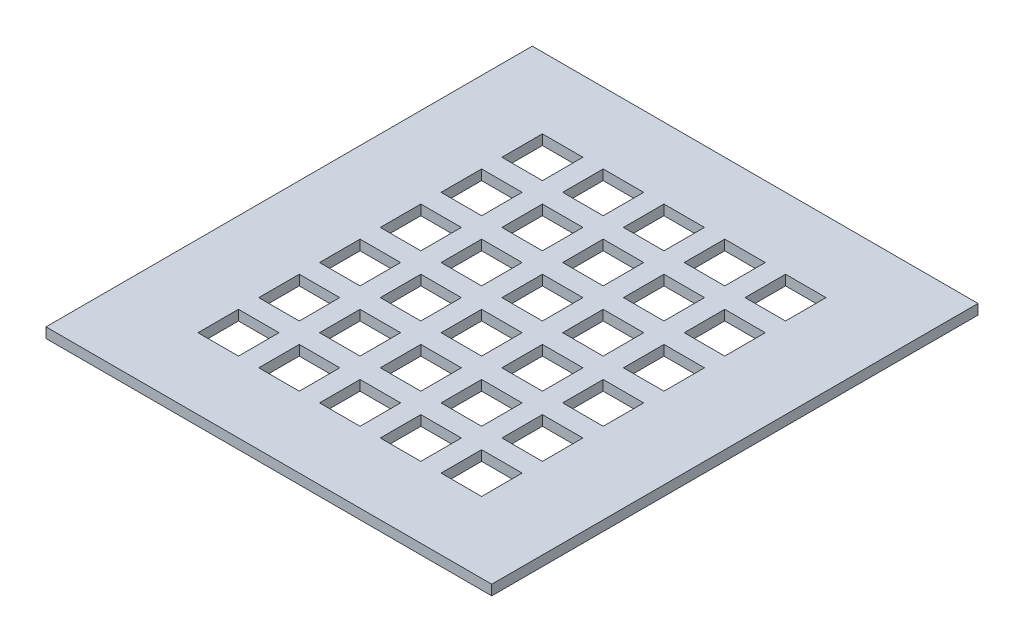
from build123d import *

# Parameters (mm, degrees)
SKETCH1_W           = 139.7
SKETCH1_H           = 3.175
BOSS_EXTRUDE1_DEPTH = 76.2
SKETCH2_W           = 12.7
SKETCH2_H           = 12.7
CUT_EXTRUDE1_DEPTH  = 104.419258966


with BuildPart() as part:
    # Sketch1 → Boss-Extrude1 (new, symmetric)
    with BuildSketch(Plane.XY):
        Rectangle(SKETCH1_W, SKETCH1_H)
    extrude(amount=BOSS_EXTRUDE1_DEPTH, both=True)

    # Sketch2 → Cut-Extrude1 (cut, through all)
    with BuildSketch(Plane(origin=(0, 1.5875, 0), x_dir=(1, 0, 0), z_dir=(0, 1, 0))):
        with Locations((38.1, -47.625)):
            Rectangle(SKETCH2_W, SKETCH2_H)
        with Locations((38.1, -28.575)):
            Rectangle(SKETCH2_W, SKETCH2_H)
        with Locations((38.1, -9.525)):
            Rectangle(SKETCH2_W, SKETCH2_H)
        with Locations((38.1, 9.525)):
            Rectangle(SKETCH2_W, SKETCH2_H)
        with Locations((38.1, 28.575)):
            Rectangle(SKETCH2_W, SKETCH2_H)
        with Locations((38.1, 47.625)):
            Rectangle(SKETCH2_W, SKETCH2_H)
        with Locations((19.05, -28.575)):
            Rectangle(SKETCH2_W, SKETCH2_H)
        with Locations((19.05, -9.525)):
            Rectangle(SKETCH2_W, SKETCH2_H)
        with Locations((19.05, 9.525)):
            Rectangle(SKETCH2_W, SKETCH2_H)
        with Locations((19.05, 28.575)):
            Rectangle(SKETCH2_W, SKETCH2_H)
        with Locations((19.05, 47.625)):
            Rectangle(SKETCH2_W, SKETCH2_H)
        with Locations((0, -28.575)):
            Rectangle(SKETCH2_W, SKETCH2_H)
        with Locations((0, -9.525)):
            Rectangle(SKETCH2_W, SKETCH2_H)
        with Locations((0, 9.525)):
            Rectangle(SKETCH2_W, SKETCH2_H)
        with Locations((0, 28.575)):
            Rectangle(SKETCH2_W, SKETCH2_H)
        with Locations((0, 47.625)):
            Rectangle(SKETCH2_W, SKETCH2_H)
        with Locations((-19.05, -28.575)):
            Rectangle(SKETCH2_W, SKETCH2_H)
        with Locations((-19.05, -9.525)):
            Rectangle(SKETCH2_W, SKETCH2_H)
        with Locations((-19.05, 9.525)):
            Rectangle(SKETCH2_W, SKETCH2_H)
        with Locations((-19.05, 28.575)):
            Rectangle(SKETCH2_W, SKETCH2_H)
        with Locations((-19.05, 47.625)):
            Rectangle(SKETCH2_W, SKETCH2_H)
        with Locations((-38.1, -28.575)):
            Rectangle(SKETCH2_W, SKETCH2_H)
        with Locations((-38.1, -9.525)):
            Rectangle(SKETCH2_W, SKETCH2_H)
        with Locations((-38.1, 9.525)):
            Rectangle(SKETCH2_W, SKETCH2_H)
        with Locations((-38.1, 28.575)):
            Rectangle(SKETCH2_W, SKETCH2_H)
        with Locations((-38.1, 47.625)):
            Rectangle(SKETCH2_W, SKETCH2_H)
        with Locations((19.05, -47.625)):
            Rectangle(SKETCH2_W, SKETCH2_H)
        with Locations((0, -47.625)):
            Rectangle(SKETCH2_W, SKETCH2_H)
        with Locations((-19.05, -47.625)):
            Rectangle(SKETCH2_W, SKETCH2_H)
        with Locations((-38.1, -47.625)):
            Rectangle(SKETCH2_W, SKETCH2_H)
    extrude(amount=-CUT_EXTRUDE1_DEPTH, mode=Mode.SUBTRACT)


solid = part.part
